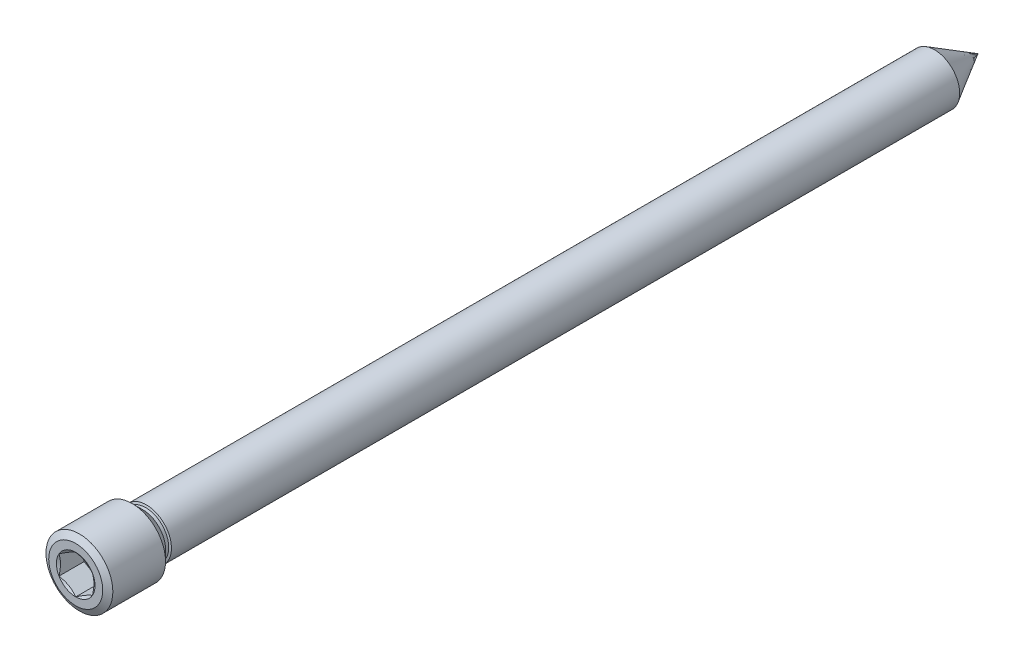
ISO-10303-21;
HEADER;
FILE_DESCRIPTION(('STEP AP214'),'2;1');
FILE_NAME('part.step','',(''),(''),'','','');
FILE_SCHEMA(('AUTOMOTIVE_DESIGN { 1 0 10303 214 1 1 1 1 }'));
ENDSEC;
DATA;
#1=APPLICATION_CONTEXT('core data for automotive mechanical design processes');
#2=APPLICATION_PROTOCOL_DEFINITION('international standard','automotive_design',2000,#1);
#3=PRODUCT_CONTEXT('',#1,'mechanical');
#4=PRODUCT('Part','Part','',(#3));
#5=PRODUCT_RELATED_PRODUCT_CATEGORY('part','',(#4));
#6=PRODUCT_DEFINITION_FORMATION('','',#4);
#7=PRODUCT_DEFINITION_CONTEXT('part definition',#1,'design');
#8=PRODUCT_DEFINITION('design','',#6,#7);
#9=PRODUCT_DEFINITION_SHAPE('','',#8);
#10=(LENGTH_UNIT() NAMED_UNIT(*) SI_UNIT(.MILLI.,.METRE.));
#11=(NAMED_UNIT(*) PLANE_ANGLE_UNIT() SI_UNIT($,.RADIAN.));
#12=(NAMED_UNIT(*) SI_UNIT($,.STERADIAN.) SOLID_ANGLE_UNIT());
#13=UNCERTAINTY_MEASURE_WITH_UNIT(LENGTH_MEASURE(1.E-05),#10,'distance_accuracy_value','');
#14=(GEOMETRIC_REPRESENTATION_CONTEXT(3) GLOBAL_UNCERTAINTY_ASSIGNED_CONTEXT((#13)) GLOBAL_UNIT_ASSIGNED_CONTEXT((#10,
#11,#12)) REPRESENTATION_CONTEXT('',''));
#15=CARTESIAN_POINT('',(0.,0.,0.));
#16=DIRECTION('',(0.,0.,1.));
#17=DIRECTION('',(1.,0.,0.));
#18=AXIS2_PLACEMENT_3D('',#15,#16,#17);
#19=CARTESIAN_POINT('',(0.,0.,-18.));
#20=DIRECTION('',(0.,0.,1.));
#21=DIRECTION('',(0.,-1.,0.));
#22=AXIS2_PLACEMENT_3D('',#19,#20,#21);
#23=CYLINDRICAL_SURFACE('',#22,2.7500000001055);
#24=CARTESIAN_POINT('',(0.,0.,-7.99999999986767));
#25=DIRECTION('',(0.,0.,1.));
#26=DIRECTION('',(0.,1.,0.));
#27=AXIS2_PLACEMENT_3D('',#24,#25,#26);
#28=CIRCLE('',#27,2.75000000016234);
#29=CARTESIAN_POINT('',(-2.7500000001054,0.,-7.99999999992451));
#30=VERTEX_POINT('',#29);
#31=CARTESIAN_POINT('',(2.7500000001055,0.,-8.));
#32=VERTEX_POINT('',#31);
#33=EDGE_CURVE('E197',#30,#32,#28,.T.);
#34=ORIENTED_EDGE('',*,*,#33,.F.);
#35=CARTESIAN_POINT('',(0.,0.,-7.99999999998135));
#36=DIRECTION('',(0.,0.,1.));
#37=DIRECTION('',(1.,0.,0.));
#38=AXIS2_PLACEMENT_3D('',#35,#36,#37);
#39=CIRCLE('',#38,2.75000000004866);
#40=EDGE_CURVE('E298',#30,#32,#39,.F.);
#41=ORIENTED_EDGE('',*,*,#40,.T.);
#42=EDGE_LOOP('',(#34,#41));
#43=FACE_BOUND('',#42,.T.);
#44=CARTESIAN_POINT('',(0.,0.,-8.38555773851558));
#45=DIRECTION('',(0.,0.,-1.));
#46=DIRECTION('',(-1.,0.,0.));
#47=AXIS2_PLACEMENT_3D('',#44,#45,#46);
#48=CIRCLE('',#47,2.7500000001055);
#49=CARTESIAN_POINT('',(-2.7331430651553,-0.304021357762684,-8.38555773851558));
#50=VERTEX_POINT('',#49);
#51=EDGE_CURVE('E9',#50,#50,#48,.T.);
#52=ORIENTED_EDGE('',*,*,#51,.F.);
#53=EDGE_LOOP('',(#52));
#54=FACE_BOUND('',#53,.T.);
#55=ADVANCED_FACE('F14',(#43,#54),#23,.T.);
#56=CARTESIAN_POINT('',(-2.,1.1547005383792,0.));
#57=DIRECTION('',(-1.,0.,0.));
#58=DIRECTION('',(0.,1.,0.));
#59=AXIS2_PLACEMENT_3D('',#56,#57,#58);
#60=PLANE('',#59);
#61=DIRECTION('',(0.,0.,-1.));
#62=VECTOR('',#61,1.);
#63=CARTESIAN_POINT('',(-2.,-1.1547005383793,0.));
#64=LINE('',#63,#62);
#65=CARTESIAN_POINT('',(-2.00000000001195,-1.1547005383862,-8.03176969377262E-12));
#66=VERTEX_POINT('',#65);
#67=CARTESIAN_POINT('',(-2.,-1.1547005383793,-3.));
#68=VERTEX_POINT('',#67);
#69=EDGE_CURVE('E294',#66,#68,#64,.T.);
#70=ORIENTED_EDGE('',*,*,#69,.T.);
#71=DIRECTION('',(0.,-1.,0.));
#72=VECTOR('',#71,1.);
#73=CARTESIAN_POINT('',(-2.,0.,-3.));
#74=LINE('',#73,#72);
#75=CARTESIAN_POINT('',(-2.,1.1547005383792,-3.));
#76=VERTEX_POINT('',#75);
#77=EDGE_CURVE('E89',#68,#76,#74,.F.);
#78=ORIENTED_EDGE('',*,*,#77,.T.);
#79=DIRECTION('',(0.,0.,-1.));
#80=VECTOR('',#79,1.);
#81=CARTESIAN_POINT('',(-2.,1.1547005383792,0.));
#82=LINE('',#81,#80);
#83=CARTESIAN_POINT('',(-2.00000000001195,1.1547005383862,-8.03176969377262E-12));
#84=VERTEX_POINT('',#83);
#85=EDGE_CURVE('E85',#76,#84,#82,.F.);
#86=ORIENTED_EDGE('',*,*,#85,.T.);
#87=CARTESIAN_POINT('',(-2.0000000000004,-1.1547005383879,-1.38916655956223E-11));
#88=CARTESIAN_POINT('',(-2.00000000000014,-1.05991107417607,-0.0273662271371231));
#89=CARTESIAN_POINT('',(-2.00000000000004,-0.964371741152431,-0.0524207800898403));
#90=CARTESIAN_POINT('',(-1.99999999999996,-0.771741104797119,-0.0967015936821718));
#91=CARTESIAN_POINT('',(-1.99999999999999,-0.674646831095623,-0.1159148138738));
#92=CARTESIAN_POINT('',(-2.00000000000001,-0.481547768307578,-0.146811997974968));
#93=CARTESIAN_POINT('',(-2.,-0.385570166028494,-0.158660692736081));
#94=CARTESIAN_POINT('',(-2.,-0.193061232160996,-0.174566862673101));
#95=CARTESIAN_POINT('',(-2.,-0.0965306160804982,-0.178632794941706));
#96=CARTESIAN_POINT('',(-2.,0.096530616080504,-0.178632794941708));
#97=CARTESIAN_POINT('',(-2.,0.193061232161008,-0.174566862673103));
#98=CARTESIAN_POINT('',(-2.,0.385570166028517,-0.158660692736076));
#99=CARTESIAN_POINT('',(-2.,0.481547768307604,-0.146811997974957));
#100=CARTESIAN_POINT('',(-2.,0.674646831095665,-0.115914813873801));
#101=CARTESIAN_POINT('',(-2.,0.771741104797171,-0.0967015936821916));
#102=CARTESIAN_POINT('',(-2.,0.964371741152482,-0.0524207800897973));
#103=CARTESIAN_POINT('',(-2.,1.05991107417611,-0.0273662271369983));
#104=CARTESIAN_POINT('',(-2.,1.1547005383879,-1.35716091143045E-11));
#105=B_SPLINE_CURVE_WITH_KNOTS('',3,(#87,#88,#89,#90,#91,#92,#93,#94,#95,#96,#97,#98,#99,#100,
#101,#102,#103,#104),.UNSPECIFIED.,.F.,.F.,(4,2,2,2,2,2,2,2,4),(0.,0.296073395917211,
0.592802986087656,0.88263085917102,1.1721436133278,1.46165636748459,1.75148424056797,
2.04821383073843,2.34428722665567),.UNSPECIFIED.);
#106=EDGE_CURVE('E76',#66,#84,#105,.T.);
#107=ORIENTED_EDGE('',*,*,#106,.F.);
#108=EDGE_LOOP('',(#70,#78,#86,#107));
#109=FACE_BOUND('',#108,.T.);
#110=ADVANCED_FACE('F87',(#109),#60,.F.);
#111=CARTESIAN_POINT('',(2.,-1.1547005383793,0.));
#112=DIRECTION('',(1.,0.,0.));
#113=DIRECTION('',(0.,-1.,0.));
#114=AXIS2_PLACEMENT_3D('',#111,#112,#113);
#115=PLANE('',#114);
#116=DIRECTION('',(0.,0.,-1.));
#117=VECTOR('',#116,1.);
#118=CARTESIAN_POINT('',(2.,1.1547005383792,0.));
#119=LINE('',#118,#117);
#120=CARTESIAN_POINT('',(2.0000000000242,1.1547005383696,-6.79664657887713E-12));
#121=VERTEX_POINT('',#120);
#122=CARTESIAN_POINT('',(2.,1.1547005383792,-3.));
#123=VERTEX_POINT('',#122);
#124=EDGE_CURVE('E93',#121,#123,#119,.T.);
#125=ORIENTED_EDGE('',*,*,#124,.T.);
#126=DIRECTION('',(0.,-1.,0.));
#127=VECTOR('',#126,1.);
#128=CARTESIAN_POINT('',(2.,0.,-3.));
#129=LINE('',#128,#127);
#130=CARTESIAN_POINT('',(2.,-1.1547005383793,-3.));
#131=VERTEX_POINT('',#130);
#132=EDGE_CURVE('E279',#123,#131,#129,.T.);
#133=ORIENTED_EDGE('',*,*,#132,.T.);
#134=DIRECTION('',(0.,0.,-1.));
#135=VECTOR('',#134,1.);
#136=CARTESIAN_POINT('',(2.,-1.1547005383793,0.));
#137=LINE('',#136,#135);
#138=CARTESIAN_POINT('',(2.00000000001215,-1.1547005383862,-8.03176969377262E-12));
#139=VERTEX_POINT('',#138);
#140=EDGE_CURVE('E289',#131,#139,#137,.F.);
#141=ORIENTED_EDGE('',*,*,#140,.T.);
#142=CARTESIAN_POINT('',(2.0000000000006,1.1547005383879,-1.38916655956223E-11));
#143=CARTESIAN_POINT('',(2.00000000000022,1.05991107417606,-0.0273662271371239));
#144=CARTESIAN_POINT('',(2.00000000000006,0.964371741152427,-0.0524207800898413));
#145=CARTESIAN_POINT('',(1.99999999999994,0.771741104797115,-0.0967015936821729));
#146=CARTESIAN_POINT('',(1.99999999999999,0.67464683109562,-0.115914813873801));
#147=CARTESIAN_POINT('',(2.00000000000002,0.481547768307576,-0.146811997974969));
#148=CARTESIAN_POINT('',(2.,0.385570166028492,-0.158660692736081));
#149=CARTESIAN_POINT('',(2.,0.193061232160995,-0.174566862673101));
#150=CARTESIAN_POINT('',(2.,0.0965306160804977,-0.178632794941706));
#151=CARTESIAN_POINT('',(2.,-0.0965306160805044,-0.178632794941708));
#152=CARTESIAN_POINT('',(2.,-0.193061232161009,-0.174566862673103));
#153=CARTESIAN_POINT('',(2.,-0.385570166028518,-0.158660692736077));
#154=CARTESIAN_POINT('',(2.,-0.481547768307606,-0.146811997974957));
#155=CARTESIAN_POINT('',(2.,-0.674646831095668,-0.1159148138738));
#156=CARTESIAN_POINT('',(2.,-0.771741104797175,-0.0967015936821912));
#157=CARTESIAN_POINT('',(2.,-0.964371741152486,-0.0524207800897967));
#158=CARTESIAN_POINT('',(2.,-1.05991107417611,-0.0273662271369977));
#159=CARTESIAN_POINT('',(2.,-1.1547005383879,-1.35716091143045E-11));
#160=B_SPLINE_CURVE_WITH_KNOTS('',3,(#142,#143,#144,#145,#146,#147,#148,#149,#150,#151,#152,
#153,#154,#155,#156,#157,#158,#159),.UNSPECIFIED.,.F.,.F.,(4,2,2,2,2,2,2,2,4),(0.,
0.29607339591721,0.592802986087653,0.882630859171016,1.17214361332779,1.46165636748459,
1.75148424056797,2.04821383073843,2.34428722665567),.UNSPECIFIED.);
#161=EDGE_CURVE('E81',#121,#139,#160,.T.);
#162=ORIENTED_EDGE('',*,*,#161,.F.);
#163=EDGE_LOOP('',(#125,#133,#141,#162));
#164=FACE_BOUND('',#163,.T.);
#165=ADVANCED_FACE('F176',(#164),#115,.F.);
#166=CARTESIAN_POINT('',(0.,0.,-3.));
#167=DIRECTION('',(0.,0.,-1.));
#168=DIRECTION('',(0.,-1.,0.));
#169=AXIS2_PLACEMENT_3D('',#166,#167,#168);
#170=PLANE('',#169);
#171=ORIENTED_EDGE('',*,*,#77,.F.);
#172=DIRECTION('',(-0.866025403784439,0.5,0.));
#173=VECTOR('',#172,1.);
#174=CARTESIAN_POINT('',(-2.,-1.1547005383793,-3.));
#175=LINE('',#174,#173);
#176=CARTESIAN_POINT('',(0.,-2.30940107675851,-3.));
#177=VERTEX_POINT('',#176);
#178=EDGE_CURVE('E292',#68,#177,#175,.F.);
#179=ORIENTED_EDGE('',*,*,#178,.T.);
#180=DIRECTION('',(-0.866025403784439,-0.5,0.));
#181=VECTOR('',#180,1.);
#182=CARTESIAN_POINT('',(0.,-2.30940107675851,-3.));
#183=LINE('',#182,#181);
#184=EDGE_CURVE('E284',#177,#131,#183,.F.);
#185=ORIENTED_EDGE('',*,*,#184,.T.);
#186=ORIENTED_EDGE('',*,*,#132,.F.);
#187=DIRECTION('',(0.866025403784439,-0.5,0.));
#188=VECTOR('',#187,1.);
#189=CARTESIAN_POINT('',(2.,1.1547005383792,-3.));
#190=LINE('',#189,#188);
#191=CARTESIAN_POINT('',(0.,2.3094010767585,-3.));
#192=VERTEX_POINT('',#191);
#193=EDGE_CURVE('E240',#123,#192,#190,.F.);
#194=ORIENTED_EDGE('',*,*,#193,.T.);
#195=DIRECTION('',(0.866025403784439,0.5,0.));
#196=VECTOR('',#195,1.);
#197=CARTESIAN_POINT('',(0.,2.3094010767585,-3.));
#198=LINE('',#197,#196);
#199=EDGE_CURVE('E94',#192,#76,#198,.F.);
#200=ORIENTED_EDGE('',*,*,#199,.T.);
#201=EDGE_LOOP('',(#171,#179,#185,#186,#194,#200));
#202=FACE_BOUND('',#201,.T.);
#203=ADVANCED_FACE('F339',(#202),#170,.F.);
#204=CARTESIAN_POINT('',(0.,-2.30940107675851,0.));
#205=DIRECTION('',(0.5,-0.866025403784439,0.));
#206=DIRECTION('',(-0.866025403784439,-0.5,0.));
#207=AXIS2_PLACEMENT_3D('',#204,#205,#206);
#208=PLANE('',#207);
#209=ORIENTED_EDGE('',*,*,#140,.F.);
#210=ORIENTED_EDGE('',*,*,#184,.F.);
#211=DIRECTION('',(0.,0.,-1.));
#212=VECTOR('',#211,1.);
#213=CARTESIAN_POINT('',(0.,-2.30940107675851,0.));
#214=LINE('',#213,#212);
#215=CARTESIAN_POINT('',(0.,-2.30940107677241,-8.03176969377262E-12));
#216=VERTEX_POINT('',#215);
#217=EDGE_CURVE('E274',#177,#216,#214,.F.);
#218=ORIENTED_EDGE('',*,*,#217,.T.);
#219=CARTESIAN_POINT('',(-8.54871728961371E-12,-2.3094010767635,-1.31867173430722E-11));
#220=CARTESIAN_POINT('',(0.0878878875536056,-2.25865898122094,-0.029304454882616));
#221=CARTESIAN_POINT('',(0.176534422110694,-2.20747888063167,-0.0559553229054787));
#222=CARTESIAN_POINT('',(0.355362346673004,-2.10423253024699,-0.102473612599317));
#223=CARTESIAN_POINT('',(0.44554691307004,-2.05216444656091,-0.122324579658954));
#224=CARTESIAN_POINT('',(0.624798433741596,-1.94867353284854,-0.153224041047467));
#225=CARTESIAN_POINT('',(0.713837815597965,-1.89726662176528,-0.1644782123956));
#226=CARTESIAN_POINT('',(0.892335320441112,-1.79421103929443,-0.177910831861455));
#227=CARTESIAN_POINT('',(0.981792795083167,-1.74256274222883,-0.180100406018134));
#228=CARTESIAN_POINT('',(1.14893448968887,-1.64606343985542,-0.175533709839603));
#229=CARTESIAN_POINT('',(1.22664379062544,-1.60119795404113,-0.169898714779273));
#230=CARTESIAN_POINT('',(1.38155614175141,-1.51175926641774,-0.152042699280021));
#231=CARTESIAN_POINT('',(1.45875865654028,-1.46718637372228,-0.139815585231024));
#232=CARTESIAN_POINT('',(1.61399014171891,-1.37756343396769,-0.109250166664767));
#233=CARTESIAN_POINT('',(1.69199947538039,-1.33252472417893,-0.0907823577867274));
#234=CARTESIAN_POINT('',(1.8468549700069,-1.24311886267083,-0.0488682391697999));
#235=CARTESIAN_POINT('',(1.92370311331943,-1.19875056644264,-0.0254317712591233));
#236=CARTESIAN_POINT('',(2.0000000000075,-1.15470053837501,-1.35967626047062E-11));
#237=B_SPLINE_CURVE_WITH_KNOTS('',3,(#219,#220,#221,#222,#223,#224,#225,#226,#227,#228,#229,
#230,#231,#232,#233,#234,#235,#236),.UNSPECIFIED.,.F.,.F.,(4,2,2,2,2,2,2,2,4),(0.,
0.317016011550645,0.634793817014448,0.944707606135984,1.25424088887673,1.52370778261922,
1.79342419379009,2.06912162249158,2.34427797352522),.UNSPECIFIED.);
#238=EDGE_CURVE('E215',#216,#139,#237,.T.);
#239=ORIENTED_EDGE('',*,*,#238,.T.);
#240=EDGE_LOOP('',(#209,#210,#218,#239));
#241=FACE_BOUND('',#240,.T.);
#242=ADVANCED_FACE('F224',(#241),#208,.F.);
#243=CARTESIAN_POINT('',(-2.,-1.1547005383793,0.));
#244=DIRECTION('',(-0.5,-0.866025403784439,0.));
#245=DIRECTION('',(-0.866025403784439,0.5,0.));
#246=AXIS2_PLACEMENT_3D('',#243,#244,#245);
#247=PLANE('',#246);
#248=ORIENTED_EDGE('',*,*,#217,.F.);
#249=ORIENTED_EDGE('',*,*,#178,.F.);
#250=ORIENTED_EDGE('',*,*,#69,.F.);
#251=CARTESIAN_POINT('',(-2.00000000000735,-1.15470053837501,-1.35967626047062E-11));
#252=CARTESIAN_POINT('',(-1.91211211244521,-1.20544263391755,-0.0293044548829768));
#253=CARTESIAN_POINT('',(-1.82346557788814,-1.25662273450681,-0.0559553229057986));
#254=CARTESIAN_POINT('',(-1.64463765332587,-1.35986908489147,-0.10247361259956));
#255=CARTESIAN_POINT('',(-1.55445308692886,-1.41193716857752,-0.122324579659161));
#256=CARTESIAN_POINT('',(-1.37520156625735,-1.51542808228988,-0.153224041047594));
#257=CARTESIAN_POINT('',(-1.28616218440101,-1.56683499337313,-0.164478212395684));
#258=CARTESIAN_POINT('',(-1.1076646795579,-1.66989057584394,-0.17791083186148));
#259=CARTESIAN_POINT('',(-1.01820720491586,-1.72153887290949,-0.180100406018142));
#260=CARTESIAN_POINT('',(-0.851065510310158,-1.8180381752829,-0.175533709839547));
#261=CARTESIAN_POINT('',(-0.773356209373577,-1.86290366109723,-0.169898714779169));
#262=CARTESIAN_POINT('',(-0.618443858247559,-1.95234234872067,-0.152042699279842));
#263=CARTESIAN_POINT('',(-0.541241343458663,-1.99691524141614,-0.139815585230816));
#264=CARTESIAN_POINT('',(-0.386009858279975,-2.08653818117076,-0.109250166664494));
#265=CARTESIAN_POINT('',(-0.308000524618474,-2.13157689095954,-0.0907823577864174));
#266=CARTESIAN_POINT('',(-0.153145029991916,-2.22098275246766,-0.0488682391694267));
#267=CARTESIAN_POINT('',(-0.0762968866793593,-2.26535104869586,-0.0254317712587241));
#268=CARTESIAN_POINT('',(8.74994521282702E-12,-2.3094010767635,-1.31867173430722E-11));
#269=B_SPLINE_CURVE_WITH_KNOTS('',3,(#251,#252,#253,#254,#255,#256,#257,#258,#259,#260,#261,
#262,#263,#264,#265,#266,#267,#268),.UNSPECIFIED.,.F.,.F.,(4,2,2,2,2,2,2,2,4),(0.,
0.317016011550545,0.634793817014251,0.944707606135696,1.25424088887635,1.52370778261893,
1.79342419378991,2.06912162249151,2.34427797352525),.UNSPECIFIED.);
#270=EDGE_CURVE('E106',#66,#216,#269,.T.);
#271=ORIENTED_EDGE('',*,*,#270,.T.);
#272=EDGE_LOOP('',(#248,#249,#250,#271));
#273=FACE_BOUND('',#272,.T.);
#274=ADVANCED_FACE('F221',(#273),#247,.F.);
#275=CARTESIAN_POINT('',(0.,2.3094010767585,0.));
#276=DIRECTION('',(-0.5,0.866025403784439,0.));
#277=DIRECTION('',(0.866025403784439,0.5,0.));
#278=AXIS2_PLACEMENT_3D('',#275,#276,#277);
#279=PLANE('',#278);
#280=ORIENTED_EDGE('',*,*,#85,.F.);
#281=ORIENTED_EDGE('',*,*,#199,.F.);
#282=DIRECTION('',(0.,0.,-1.));
#283=VECTOR('',#282,1.);
#284=CARTESIAN_POINT('',(0.,2.3094010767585,0.));
#285=LINE('',#284,#283);
#286=CARTESIAN_POINT('',(0.,2.3094010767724,-8.03176969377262E-12));
#287=VERTEX_POINT('',#286);
#288=EDGE_CURVE('E101',#192,#287,#285,.F.);
#289=ORIENTED_EDGE('',*,*,#288,.T.);
#290=CARTESIAN_POINT('',(8.74994521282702E-12,2.3094010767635,-1.31867173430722E-11));
#291=CARTESIAN_POINT('',(-0.0878878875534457,2.258658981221,-0.0293044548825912));
#292=CARTESIAN_POINT('',(-0.176534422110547,2.20747888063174,-0.055955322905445));
#293=CARTESIAN_POINT('',(-0.355362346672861,2.10423253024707,-0.102473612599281));
#294=CARTESIAN_POINT('',(-0.445546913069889,2.05216444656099,-0.122324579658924));
#295=CARTESIAN_POINT('',(-0.624798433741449,1.94867353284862,-0.15322404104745));
#296=CARTESIAN_POINT('',(-0.713837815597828,1.89726662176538,-0.164478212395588));
#297=CARTESIAN_POINT('',(-0.892335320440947,1.79421103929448,-0.177910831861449));
#298=CARTESIAN_POINT('',(-0.981792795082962,1.74256274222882,-0.180100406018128));
#299=CARTESIAN_POINT('',(-1.14893448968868,1.64606343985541,-0.175533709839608));
#300=CARTESIAN_POINT('',(-1.22664379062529,1.60119795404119,-0.169898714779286));
#301=CARTESIAN_POINT('',(-1.3815561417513,1.51175926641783,-0.152042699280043));
#302=CARTESIAN_POINT('',(-1.45875865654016,1.46718637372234,-0.139815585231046));
#303=CARTESIAN_POINT('',(-1.61399014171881,1.37756343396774,-0.109250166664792));
#304=CARTESIAN_POINT('',(-1.6919994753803,1.33252472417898,-0.0907823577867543));
#305=CARTESIAN_POINT('',(-1.84685497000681,1.24311886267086,-0.0488682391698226));
#306=CARTESIAN_POINT('',(-1.92370311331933,1.19875056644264,-0.0254317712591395));
#307=CARTESIAN_POINT('',(-2.00000000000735,1.1547005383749,-1.35967626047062E-11));
#308=B_SPLINE_CURVE_WITH_KNOTS('',3,(#290,#291,#292,#293,#294,#295,#296,#297,#298,#299,#300,
#301,#302,#303,#304,#305,#306,#307),.UNSPECIFIED.,.F.,.F.,(4,2,2,2,2,2,2,2,4),(0.,
0.317016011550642,0.634793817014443,0.944707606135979,1.25424088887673,1.52370778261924,
1.79342419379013,2.06912162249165,2.34427797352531),.UNSPECIFIED.);
#309=EDGE_CURVE('E97',#287,#84,#308,.T.);
#310=ORIENTED_EDGE('',*,*,#309,.T.);
#311=EDGE_LOOP('',(#280,#281,#289,#310));
#312=FACE_BOUND('',#311,.T.);
#313=ADVANCED_FACE('F99',(#312),#279,.F.);
#314=CARTESIAN_POINT('',(2.,1.1547005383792,0.));
#315=DIRECTION('',(0.5,0.866025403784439,0.));
#316=DIRECTION('',(0.866025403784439,-0.5,0.));
#317=AXIS2_PLACEMENT_3D('',#314,#315,#316);
#318=PLANE('',#317);
#319=ORIENTED_EDGE('',*,*,#288,.F.);
#320=ORIENTED_EDGE('',*,*,#193,.F.);
#321=ORIENTED_EDGE('',*,*,#124,.F.);
#322=CARTESIAN_POINT('',(2.0000000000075,1.1547005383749,-1.35967626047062E-11));
#323=CARTESIAN_POINT('',(1.91211211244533,1.2054426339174,-0.0293044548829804));
#324=CARTESIAN_POINT('',(1.82346557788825,1.25662273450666,-0.0559553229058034));
#325=CARTESIAN_POINT('',(1.64463765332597,1.35986908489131,-0.10247361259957));
#326=CARTESIAN_POINT('',(1.55445308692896,1.41193716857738,-0.122324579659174));
#327=CARTESIAN_POINT('',(1.37520156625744,1.51542808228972,-0.153224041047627));
#328=CARTESIAN_POINT('',(1.28616218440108,1.56683499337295,-0.164478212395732));
#329=CARTESIAN_POINT('',(1.107664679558,1.66989057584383,-0.177910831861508));
#330=CARTESIAN_POINT('',(1.01820720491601,1.72153887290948,-0.180100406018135));
#331=CARTESIAN_POINT('',(0.851065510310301,1.81803817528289,-0.175533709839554));
#332=CARTESIAN_POINT('',(0.773356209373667,1.86290366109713,-0.169898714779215));
#333=CARTESIAN_POINT('',(0.618443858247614,1.9523423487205,-0.152042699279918));
#334=CARTESIAN_POINT('',(0.541241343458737,1.99691524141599,-0.139815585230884));
#335=CARTESIAN_POINT('',(0.386009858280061,2.08653818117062,-0.109250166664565));
#336=CARTESIAN_POINT('',(0.308000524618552,2.13157689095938,-0.0907823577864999));
#337=CARTESIAN_POINT('',(0.153145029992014,2.22098275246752,-0.0488682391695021));
#338=CARTESIAN_POINT('',(0.0762968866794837,2.26535104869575,-0.0254317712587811));
#339=CARTESIAN_POINT('',(-8.54871728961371E-12,2.3094010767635,-1.31867173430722E-11));
#340=B_SPLINE_CURVE_WITH_KNOTS('',3,(#322,#323,#324,#325,#326,#327,#328,#329,#330,#331,#332,
#333,#334,#335,#336,#337,#338,#339),.UNSPECIFIED.,.F.,.F.,(4,2,2,2,2,2,2,2,4),(0.,
0.317016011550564,0.634793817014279,0.944707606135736,1.25424088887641,1.52370778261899,
1.79342419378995,2.06912162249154,2.34427797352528),.UNSPECIFIED.);
#341=EDGE_CURVE('E105',#121,#287,#340,.T.);
#342=ORIENTED_EDGE('',*,*,#341,.T.);
#343=EDGE_LOOP('',(#319,#320,#321,#342));
#344=FACE_BOUND('',#343,.T.);
#345=ADVANCED_FACE('F143',(#344),#318,.F.);
#346=CARTESIAN_POINT('',(0.,0.,0.));
#347=DIRECTION('',(0.,0.,1.));
#348=DIRECTION('',(1.,0.,0.));
#349=AXIS2_PLACEMENT_3D('',#346,#347,#348);
#350=CONICAL_SURFACE('',#349,2.30940107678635,1.04719755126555);
#351=ORIENTED_EDGE('',*,*,#161,.T.);
#352=CARTESIAN_POINT('',(0.,0.,0.));
#353=DIRECTION('',(0.,0.,1.));
#354=DIRECTION('',(1.,0.,0.));
#355=AXIS2_PLACEMENT_3D('',#352,#353,#354);
#356=CIRCLE('',#355,2.30940107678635);
#357=EDGE_CURVE('E127',#121,#139,#356,.F.);
#358=ORIENTED_EDGE('',*,*,#357,.F.);
#359=EDGE_LOOP('',(#351,#358));
#360=FACE_BOUND('',#359,.T.);
#361=ADVANCED_FACE('F232',(#360),#350,.F.);
#362=CARTESIAN_POINT('',(0.,0.,0.));
#363=DIRECTION('',(0.,0.,1.));
#364=DIRECTION('',(1.,0.,0.));
#365=AXIS2_PLACEMENT_3D('',#362,#363,#364);
#366=CONICAL_SURFACE('',#365,2.30940107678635,1.04719755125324);
#367=CARTESIAN_POINT('',(0.,0.,0.));
#368=DIRECTION('',(0.,0.,1.));
#369=DIRECTION('',(1.,0.,0.));
#370=AXIS2_PLACEMENT_3D('',#367,#368,#369);
#371=CIRCLE('',#370,2.30940107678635);
#372=EDGE_CURVE('E122',#139,#216,#371,.F.);
#373=ORIENTED_EDGE('',*,*,#372,.F.);
#374=ORIENTED_EDGE('',*,*,#238,.F.);
#375=EDGE_LOOP('',(#373,#374));
#376=FACE_BOUND('',#375,.T.);
#377=ADVANCED_FACE('F206',(#376),#366,.F.);
#378=CARTESIAN_POINT('',(0.,0.,0.));
#379=DIRECTION('',(0.,0.,1.));
#380=DIRECTION('',(1.,0.,0.));
#381=AXIS2_PLACEMENT_3D('',#378,#379,#380);
#382=CONICAL_SURFACE('',#381,2.30940107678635,1.04719755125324);
#383=CARTESIAN_POINT('',(0.,0.,0.));
#384=DIRECTION('',(0.,0.,1.));
#385=DIRECTION('',(1.,0.,0.));
#386=AXIS2_PLACEMENT_3D('',#383,#384,#385);
#387=CIRCLE('',#386,2.30940107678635);
#388=EDGE_CURVE('E120',#216,#66,#387,.F.);
#389=ORIENTED_EDGE('',*,*,#388,.F.);
#390=ORIENTED_EDGE('',*,*,#270,.F.);
#391=EDGE_LOOP('',(#389,#390));
#392=FACE_BOUND('',#391,.T.);
#393=ADVANCED_FACE('F202',(#392),#382,.F.);
#394=CARTESIAN_POINT('',(0.,0.,0.));
#395=DIRECTION('',(0.,0.,1.));
#396=DIRECTION('',(1.,0.,0.));
#397=AXIS2_PLACEMENT_3D('',#394,#395,#396);
#398=CONICAL_SURFACE('',#397,2.30940107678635,1.04719755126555);
#399=ORIENTED_EDGE('',*,*,#106,.T.);
#400=CARTESIAN_POINT('',(0.,0.,0.));
#401=DIRECTION('',(0.,0.,1.));
#402=DIRECTION('',(1.,0.,0.));
#403=AXIS2_PLACEMENT_3D('',#400,#401,#402);
#404=CIRCLE('',#403,2.30940107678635);
#405=EDGE_CURVE('E74',#66,#84,#404,.F.);
#406=ORIENTED_EDGE('',*,*,#405,.F.);
#407=EDGE_LOOP('',(#399,#406));
#408=FACE_BOUND('',#407,.T.);
#409=ADVANCED_FACE('F78',(#408),#398,.F.);
#410=CARTESIAN_POINT('',(0.,0.,0.));
#411=DIRECTION('',(0.,0.,1.));
#412=DIRECTION('',(1.,0.,0.));
#413=AXIS2_PLACEMENT_3D('',#410,#411,#412);
#414=CONICAL_SURFACE('',#413,2.30940107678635,1.04719755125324);
#415=CARTESIAN_POINT('',(0.,0.,0.));
#416=DIRECTION('',(0.,0.,1.));
#417=DIRECTION('',(1.,0.,0.));
#418=AXIS2_PLACEMENT_3D('',#415,#416,#417);
#419=CIRCLE('',#418,2.30940107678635);
#420=EDGE_CURVE('E109',#84,#287,#419,.F.);
#421=ORIENTED_EDGE('',*,*,#420,.F.);
#422=ORIENTED_EDGE('',*,*,#309,.F.);
#423=EDGE_LOOP('',(#421,#422));
#424=FACE_BOUND('',#423,.T.);
#425=ADVANCED_FACE('F110',(#424),#414,.F.);
#426=CARTESIAN_POINT('',(0.,0.,0.));
#427=DIRECTION('',(0.,0.,1.));
#428=DIRECTION('',(1.,0.,0.));
#429=AXIS2_PLACEMENT_3D('',#426,#427,#428);
#430=CONICAL_SURFACE('',#429,2.30940107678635,1.04719755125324);
#431=CARTESIAN_POINT('',(0.,0.,0.));
#432=DIRECTION('',(0.,0.,1.));
#433=DIRECTION('',(1.,0.,0.));
#434=AXIS2_PLACEMENT_3D('',#431,#432,#433);
#435=CIRCLE('',#434,2.30940107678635);
#436=EDGE_CURVE('E113',#287,#121,#435,.F.);
#437=ORIENTED_EDGE('',*,*,#436,.F.);
#438=ORIENTED_EDGE('',*,*,#341,.F.);
#439=EDGE_LOOP('',(#437,#438));
#440=FACE_BOUND('',#439,.T.);
#441=ADVANCED_FACE('F146',(#440),#430,.F.);
#442=CARTESIAN_POINT('',(2.77120053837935,0.,0.));
#443=DIRECTION('',(0.,0.,1.));
#444=DIRECTION('',(1.,0.,0.));
#445=AXIS2_PLACEMENT_3D('',#442,#443,#444);
#446=PLANE('',#445);
#447=ORIENTED_EDGE('',*,*,#420,.T.);
#448=ORIENTED_EDGE('',*,*,#436,.T.);
#449=ORIENTED_EDGE('',*,*,#357,.T.);
#450=ORIENTED_EDGE('',*,*,#372,.T.);
#451=ORIENTED_EDGE('',*,*,#388,.T.);
#452=ORIENTED_EDGE('',*,*,#405,.T.);
#453=EDGE_LOOP('',(#447,#448,#449,#450,#451,#452));
#454=FACE_BOUND('',#453,.T.);
#455=CARTESIAN_POINT('',(0.,0.,2.40293895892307E-11));
#456=DIRECTION('',(0.,0.,-1.));
#457=DIRECTION('',(-1.,0.,0.));
#458=AXIS2_PLACEMENT_3D('',#455,#456,#457);
#459=CIRCLE('',#458,3.23299999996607);
#460=CARTESIAN_POINT('',(-3.23299999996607,0.,2.40295118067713E-11));
#461=VERTEX_POINT('',#460);
#462=EDGE_CURVE('E263',#461,#461,#459,.T.);
#463=ORIENTED_EDGE('',*,*,#462,.F.);
#464=EDGE_LOOP('',(#463));
#465=FACE_BOUND('',#464,.T.);
#466=ADVANCED_FACE('F116',(#454,#465),#446,.T.);
#467=CARTESIAN_POINT('',(0.,0.,-6.7500000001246));
#468=DIRECTION('',(0.,0.,1.));
#469=DIRECTION('',(1.,0.,0.));
#470=AXIS2_PLACEMENT_3D('',#467,#468,#469);
#471=CONICAL_SURFACE('',#470,3.99999999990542,0.785398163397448);
#472=DIRECTION('',(0.707106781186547,0.,-0.707106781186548));
#473=VECTOR('',#472,1.);
#474=CARTESIAN_POINT('',(-499000.,2.62997956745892E-10,498989.25));
#475=LINE('',#474,#473);
#476=CARTESIAN_POINT('',(-3.99999999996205,0.,-6.75000000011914));
#477=VERTEX_POINT('',#476);
#478=EDGE_CURVE('E31',#477,#30,#475,.T.);
#479=ORIENTED_EDGE('',*,*,#478,.F.);
#480=CARTESIAN_POINT('',(0.,0.,-6.75));
#481=DIRECTION('',(0.,0.,1.));
#482=DIRECTION('',(1.,0.,0.));
#483=AXIS2_PLACEMENT_3D('',#480,#481,#482);
#484=CIRCLE('',#483,4.);
#485=CARTESIAN_POINT('',(3.99999999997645,0.,-6.75000000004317));
#486=VERTEX_POINT('',#485);
#487=EDGE_CURVE('E259',#486,#477,#484,.T.);
#488=ORIENTED_EDGE('',*,*,#487,.F.);
#489=DIRECTION('',(-0.707106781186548,0.,-0.707106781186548));
#490=VECTOR('',#489,1.);
#491=CARTESIAN_POINT('',(499000.,-2.34499919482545E-10,498989.25));
#492=LINE('',#491,#490);
#493=EDGE_CURVE('E254',#32,#486,#492,.F.);
#494=ORIENTED_EDGE('',*,*,#493,.F.);
#495=ORIENTED_EDGE('',*,*,#40,.F.);
#496=EDGE_LOOP('',(#479,#488,#494,#495));
#497=FACE_BOUND('',#496,.T.);
#498=ADVANCED_FACE('F155',(#497),#471,.T.);
#499=CARTESIAN_POINT('',(0.,0.,-0.442827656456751));
#500=DIRECTION('',(0.,0.,-1.));
#501=DIRECTION('',(-1.,0.,0.));
#502=AXIS2_PLACEMENT_3D('',#499,#500,#501);
#503=CONICAL_SURFACE('',#502,3.99999999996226,1.04719755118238);
#504=ORIENTED_EDGE('',*,*,#462,.T.);
#505=EDGE_LOOP('',(#504));
#506=FACE_BOUND('',#505,.T.);
#507=CARTESIAN_POINT('',(0.,0.,-0.442827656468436));
#508=DIRECTION('',(0.,0.,1.));
#509=DIRECTION('',(1.,0.,0.));
#510=AXIS2_PLACEMENT_3D('',#507,#508,#509);
#511=CIRCLE('',#510,4.);
#512=CARTESIAN_POINT('',(4.,0.,-0.442827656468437));
#513=VERTEX_POINT('',#512);
#514=EDGE_CURVE('E268',#513,#513,#511,.F.);
#515=ORIENTED_EDGE('',*,*,#514,.F.);
#516=EDGE_LOOP('',(#515));
#517=FACE_BOUND('',#516,.T.);
#518=ADVANCED_FACE('F158',(#506,#517),#503,.T.);
#519=CARTESIAN_POINT('',(0.,0.,-6.75000000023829));
#520=DIRECTION('',(0.,0.,1.));
#521=DIRECTION('',(0.,1.,0.));
#522=AXIS2_PLACEMENT_3D('',#519,#520,#521);
#523=CONICAL_SURFACE('',#522,3.99999999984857,0.785398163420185);
#524=ORIENTED_EDGE('',*,*,#478,.T.);
#525=ORIENTED_EDGE('',*,*,#33,.T.);
#526=ORIENTED_EDGE('',*,*,#493,.T.);
#527=CARTESIAN_POINT('',(0.,0.,-6.75));
#528=DIRECTION('',(0.,0.,1.));
#529=DIRECTION('',(1.,0.,0.));
#530=AXIS2_PLACEMENT_3D('',#527,#528,#529);
#531=CIRCLE('',#530,4.);
#532=EDGE_CURVE('E23',#477,#486,#531,.T.);
#533=ORIENTED_EDGE('',*,*,#532,.F.);
#534=EDGE_LOOP('',(#524,#525,#526,#533));
#535=FACE_BOUND('',#534,.T.);
#536=ADVANCED_FACE('F160',(#535),#523,.T.);
#537=CARTESIAN_POINT('',(0.,0.,-3.59641382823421));
#538=DIRECTION('',(0.,0.,1.));
#539=DIRECTION('',(1.,0.,0.));
#540=AXIS2_PLACEMENT_3D('',#537,#538,#539);
#541=CYLINDRICAL_SURFACE('',#540,4.);
#542=ORIENTED_EDGE('',*,*,#514,.T.);
#543=EDGE_LOOP('',(#542));
#544=FACE_BOUND('',#543,.T.);
#545=ORIENTED_EDGE('',*,*,#532,.T.);
#546=ORIENTED_EDGE('',*,*,#487,.T.);
#547=EDGE_LOOP('',(#545,#546));
#548=FACE_BOUND('',#547,.T.);
#549=ADVANCED_FACE('F16',(#544,#548),#541,.T.);
#550=CARTESIAN_POINT('',(0.,0.,-18.));
#551=DIRECTION('',(0.,0.,-1.));
#552=DIRECTION('',(-0.99387020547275,-0.110553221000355,0.));
#553=AXIS2_PLACEMENT_3D('',#550,#551,#552);
#554=SPHERICAL_SURFACE('',#553,10.);
#555=CARTESIAN_POINT('',(0.,0.,-8.46060798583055));
#556=DIRECTION('',(0.,0.,-1.));
#557=DIRECTION('',(-0.110553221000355,0.99387020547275,0.));
#558=AXIS2_PLACEMENT_3D('',#555,#556,#557);
#559=CIRCLE('',#558,3.);
#560=CARTESIAN_POINT('',(-2.98161061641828,-0.331659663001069,-8.46060798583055));
#561=VERTEX_POINT('',#560);
#562=EDGE_CURVE('E322',#561,#561,#559,.T.);
#563=CARTESIAN_POINT('',(-2.98161061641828,-0.331659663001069,-8.46060798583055));
#564=CARTESIAN_POINT('',(-2.97903270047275,-0.331372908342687,-8.4597922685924));
#565=CARTESIAN_POINT('',(-2.97645445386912,-0.331086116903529,-8.45897760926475));
#566=CARTESIAN_POINT('',(-2.97129730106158,-0.330512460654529,-8.45735040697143));
#567=CARTESIAN_POINT('',(-2.96871839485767,-0.330225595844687,-8.45653786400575));
#568=CARTESIAN_POINT('',(-2.96355992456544,-0.329651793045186,-8.45491489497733));
#569=CARTESIAN_POINT('',(-2.96098036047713,-0.329364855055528,-8.45410446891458));
#570=CARTESIAN_POINT('',(-2.95582057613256,-0.328790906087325,-8.45248573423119));
#571=CARTESIAN_POINT('',(-2.95324035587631,-0.328503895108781,-8.45167742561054));
#572=CARTESIAN_POINT('',(-2.94807926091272,-0.32792980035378,-8.45006292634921));
#573=CARTESIAN_POINT('',(-2.94549838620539,-0.327642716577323,-8.44925673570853));
#574=CARTESIAN_POINT('',(-2.94033598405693,-0.327068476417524,-8.44764647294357));
#575=CARTESIAN_POINT('',(-2.93775445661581,-0.32678132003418,-8.44684240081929));
#576=CARTESIAN_POINT('',(-2.93259075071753,-0.326206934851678,-8.44523637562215));
#577=CARTESIAN_POINT('',(-2.93000857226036,-0.325919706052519,-8.44443442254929));
#578=CARTESIAN_POINT('',(-2.92484356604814,-0.325345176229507,-8.44283263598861));
#579=CARTESIAN_POINT('',(-2.92226073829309,-0.325057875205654,-8.44203280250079));
#580=CARTESIAN_POINT('',(-2.91709443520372,-0.324483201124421,-8.44043525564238));
#581=CARTESIAN_POINT('',(-2.91451095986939,-0.324195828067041,-8.43963754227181));
#582=CARTESIAN_POINT('',(-2.90934336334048,-0.323621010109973,-8.43804423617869));
#583=CARTESIAN_POINT('',(-2.9067592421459,-0.323333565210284,-8.43724864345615));
#584=CARTESIAN_POINT('',(-2.90159035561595,-0.32275860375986,-8.43565957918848));
#585=CARTESIAN_POINT('',(-2.89900559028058,-0.322471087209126,-8.43486610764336));
#586=CARTESIAN_POINT('',(-2.89383541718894,-0.321895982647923,-8.43328128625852));
#587=CARTESIAN_POINT('',(-2.89125000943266,-0.321608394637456,-8.43248993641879));
#588=CARTESIAN_POINT('',(-2.88607855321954,-0.321033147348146,-8.43090935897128));
#589=CARTESIAN_POINT('',(-2.88349250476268,-0.320745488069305,-8.4301201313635));
#590=CARTESIAN_POINT('',(-2.87831976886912,-0.320170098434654,-8.42854379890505));
#591=CARTESIAN_POINT('',(-2.87573308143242,-0.319882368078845,-8.42775669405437));
#592=CARTESIAN_POINT('',(-2.87055906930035,-0.319306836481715,-8.42618460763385));
#593=CARTESIAN_POINT('',(-2.86797174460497,-0.319019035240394,-8.425399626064));
#594=CARTESIAN_POINT('',(-2.86279645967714,-0.31844336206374,-8.42383178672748));
#595=CARTESIAN_POINT('',(-2.86020849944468,-0.318155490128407,-8.42304892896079));
#596=CARTESIAN_POINT('',(-2.8550319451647,-0.317579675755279,-8.42148533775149));
#597=CARTESIAN_POINT('',(-2.85244335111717,-0.317291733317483,-8.42070460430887));
#598=CARTESIAN_POINT('',(-2.84726553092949,-0.316715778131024,-8.41914526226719));
#599=CARTESIAN_POINT('',(-2.84467630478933,-0.316427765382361,-8.41836665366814));
#600=CARTESIAN_POINT('',(-2.83949722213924,-0.315851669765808,-8.41681156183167));
#601=CARTESIAN_POINT('',(-2.83690736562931,-0.31556358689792,-8.41603507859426));
#602=CARTESIAN_POINT('',(-2.83172702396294,-0.314987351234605,-8.41448423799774));
#603=CARTESIAN_POINT('',(-2.82913653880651,-0.31469919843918,-8.41370988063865));
#604=CARTESIAN_POINT('',(-2.82395494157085,-0.314122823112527,-8.41216329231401));
#605=CARTESIAN_POINT('',(-2.82136382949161,-0.313834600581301,-8.41139106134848));
#606=CARTESIAN_POINT('',(-2.81618098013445,-0.313258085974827,-8.40984872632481));
#607=CARTESIAN_POINT('',(-2.81358924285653,-0.312969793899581,-8.40907862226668));
#608=CARTESIAN_POINT('',(-2.80840514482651,-0.312393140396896,-8.40754054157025));
#609=CARTESIAN_POINT('',(-2.80581278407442,-0.312104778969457,-8.40677256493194));
#610=CARTESIAN_POINT('',(-2.80062744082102,-0.311527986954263,-8.40523873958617));
#611=CARTESIAN_POINT('',(-2.7980344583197,-0.311239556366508,-8.4044728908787));
#612=CARTESIAN_POINT('',(-2.79284787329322,-0.310662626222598,-8.40294332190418));
#613=CARTESIAN_POINT('',(-2.79025427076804,-0.310374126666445,-8.40217960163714));
#614=CARTESIAN_POINT('',(-2.78506644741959,-0.309797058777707,-8.40065429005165));
#615=CARTESIAN_POINT('',(-2.78247222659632,-0.309508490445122,-8.39989269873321));
#616=CARTESIAN_POINT('',(-2.77728316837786,-0.308931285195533,-8.39837164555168));
#617=CARTESIAN_POINT('',(-2.77468833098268,-0.308642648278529,-8.3976121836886));
#618=CARTESIAN_POINT('',(-2.76949804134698,-0.308065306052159,-8.39609538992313));
#619=CARTESIAN_POINT('',(-2.76690258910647,-0.307776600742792,-8.39533805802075));
#620=CARTESIAN_POINT('',(-2.76171107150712,-0.3071991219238,-8.39382552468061));
#621=CARTESIAN_POINT('',(-2.75911500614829,-0.306910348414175,-8.39307032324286));
#622=CARTESIAN_POINT('',(-2.7539222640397,-0.306332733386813,-8.39156205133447));
#623=CARTESIAN_POINT('',(-2.75132558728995,-0.306043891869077,-8.39080898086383));
#624=CARTESIAN_POINT('',(-2.74613162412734,-0.305466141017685,-8.38930497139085));
#625=CARTESIAN_POINT('',(-2.74353433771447,-0.30517723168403,-8.3885540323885));
#626=CARTESIAN_POINT('',(-2.73833915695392,-0.304599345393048,-8.38705428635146));
#627=CARTESIAN_POINT('',(-2.73574126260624,-0.304310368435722,-8.38630547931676));
#628=CARTESIAN_POINT('',(-2.7331430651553,-0.304021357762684,-8.38555773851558));
#629=B_SPLINE_CURVE_WITH_KNOTS('',3,(#563,#564,#565,#566,#567,#568,#569,#570,#571,#572,#573,
#574,#575,#576,#577,#578,#579,#580,#581,#582,#583,#584,#585,#586,#587,#588,#589,#590,#591,#592,
#593,#594,#595,#596,#597,#598,#599,#600,#601,#602,#603,#604,#605,#606,#607,#608,#609,#610,#611,
#612,#613,#614,#615,#616,#617,#618,#619,#620,#621,#622,#623,#624,#625,#626,#627,#628),
.UNSPECIFIED.,.F.,.F.,(4,2,2,2,2,2,2,2,2,2,2,2,2,2,2,2,2,2,2,2,2,2,2,2,2,2,2,2,2,2,2,2,4),(0.,
0.0081571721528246,0.0163143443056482,0.0244715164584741,0.0326286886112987,0.0407858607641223,
0.0489430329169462,0.05710020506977,0.0652573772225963,0.0734145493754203,0.0815717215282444,
0.0897288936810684,0.0978860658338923,0.106043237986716,0.114200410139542,0.122357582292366,
0.130514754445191,0.138671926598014,0.146829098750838,0.154986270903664,0.163143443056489,
0.171300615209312,0.179457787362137,0.18761495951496,0.195772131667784,0.20392930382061,
0.212086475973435,0.220243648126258,0.228400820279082,0.236557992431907,0.244715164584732,
0.252872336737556,0.26102950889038),.UNSPECIFIED.);
#630=EDGE_CURVE('BSEAM168',#561,#50,#629,.T.);
#631=ORIENTED_EDGE('',*,*,#562,.F.);
#632=ORIENTED_EDGE('',*,*,#51,.T.);
#633=ORIENTED_EDGE('',*,*,#630,.T.);
#634=ORIENTED_EDGE('',*,*,#630,.F.);
#635=EDGE_LOOP('',(#631,#633,#632,#634));
#636=FACE_BOUND('',#635,.T.);
#637=ADVANCED_FACE('F168',(#636),#554,.T.);
#638=CARTESIAN_POINT('',(0.,0.,-108.));
#639=DIRECTION('',(0.,0.,1.));
#640=DIRECTION('',(0.110553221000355,-0.99387020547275,0.));
#641=AXIS2_PLACEMENT_3D('',#638,#639,#640);
#642=CYLINDRICAL_SURFACE('',#641,3.);
#643=ORIENTED_EDGE('',*,*,#562,.T.);
#644=EDGE_LOOP('',(#643));
#645=FACE_BOUND('',#644,.T.);
#646=CARTESIAN_POINT('',(0.,0.,-102.803847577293));
#647=DIRECTION('',(0.,0.,-1.));
#648=DIRECTION('',(-0.110553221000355,0.99387020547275,0.));
#649=AXIS2_PLACEMENT_3D('',#646,#647,#648);
#650=CIRCLE('',#649,3.);
#651=CARTESIAN_POINT('',(-0.331659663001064,2.98161061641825,-102.803847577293));
#652=VERTEX_POINT('',#651);
#653=EDGE_CURVE('E82',#652,#652,#650,.F.);
#654=ORIENTED_EDGE('',*,*,#653,.T.);
#655=EDGE_LOOP('',(#654));
#656=FACE_BOUND('',#655,.T.);
#657=ADVANCED_FACE('F312',(#645,#656),#642,.T.);
#658=CARTESIAN_POINT('',(0.,0.,-102.803847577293));
#659=DIRECTION('',(0.,0.,1.));
#660=DIRECTION('',(0.110553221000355,-0.99387020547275,0.));
#661=AXIS2_PLACEMENT_3D('',#658,#659,#660);
#662=CONICAL_SURFACE('',#661,3.,0.5235987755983);
#663=ORIENTED_EDGE('',*,*,#653,.F.);
#664=EDGE_LOOP('',(#663));
#665=FACE_BOUND('',#664,.T.);
#666=CARTESIAN_POINT('',(0.,0.,-108.));
#667=VERTEX_POINT('',#666);
#668=VERTEX_LOOP('',#667);
#669=FACE_BOUND('',#668,.T.);
#670=ADVANCED_FACE('F310',(#665,#669),#662,.T.);
#671=CLOSED_SHELL('',(#55,#110,#165,#203,#242,#274,#313,#345,#361,#377,#393,#409,#425,#441,#466,
#498,#518,#536,#549,#637,#657,#670));
#672=MANIFOLD_SOLID_BREP('B1',#671);
#673=ADVANCED_BREP_SHAPE_REPRESENTATION('',(#18,#672),#14);
#674=SHAPE_DEFINITION_REPRESENTATION(#9,#673);
ENDSEC;
END-ISO-10303-21;
